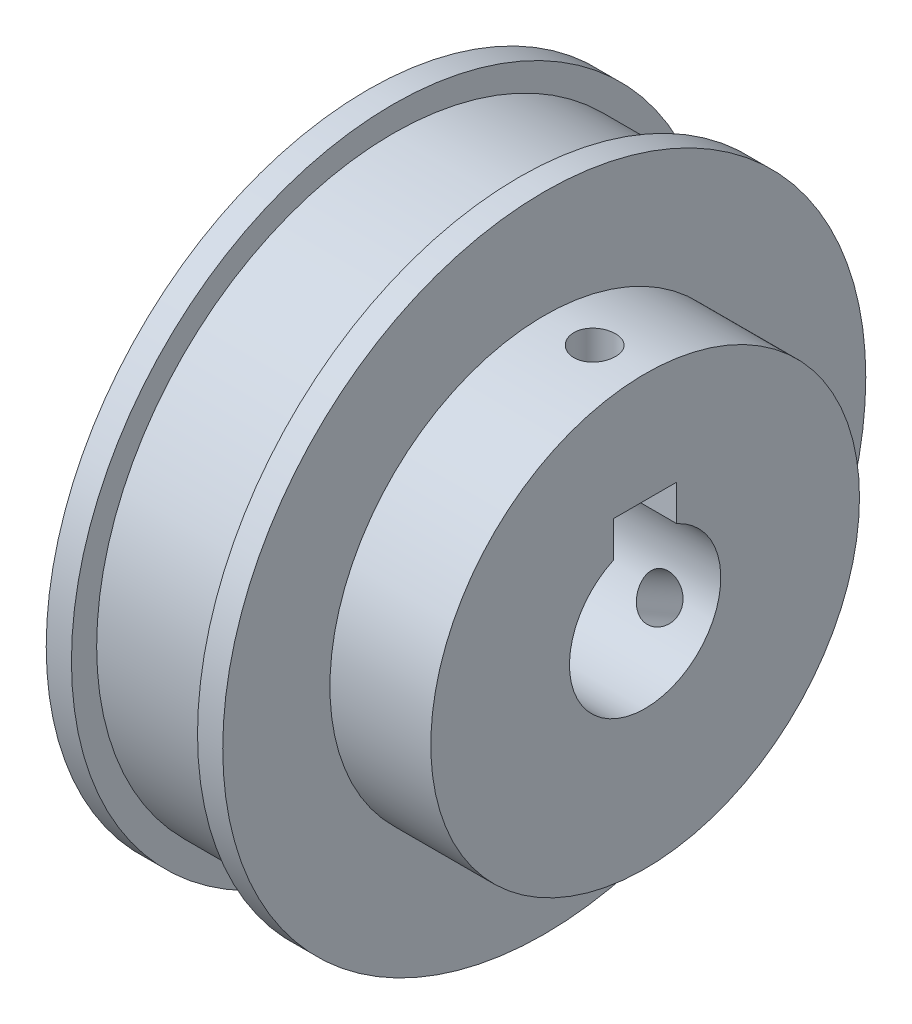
from build123d import *

# Parameters (mm, degrees)
SKETCH_1_R               = 25.5
EXTRUDE_1_DEPTH          = 22
SKETCH_2_OUTSIDE_W       = 68.082
SKETCH_2_OUTSIDE_H       = 68.082
SKETCH_2_OUTSIDE_R       = 23.5
CUT_EXTRUDE_1_DEPTH      = 10
SKETCH_3_OUTSIDE_W       = 68.082
SKETCH_3_OUTSIDE_H       = 68.082
SKETCH_3_OUTSIDE_R       = 17
CUT_EXTRUDE_2_DEPTH      = 8
SKETCH_4_R               = 6
CUT_EXTRUDE_3_DEPTH      = 43.243342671
SKETCH_5_W               = 5
SKETCH_5_H               = 2.845643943
CUT_EXTRUDE_4_DEPTH      = 43.243342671
SKETCH_6_R               = 1.65
CUT_EXTRUDE_5_DEPTH      = 43.243342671
PATTERN_CIRCULAR_1_COUNT = 2
PATTERN_CIRCULAR_1_ANGLE = 120


with BuildPart() as part:
    # Sketch 1 → Extrude 1 (new body)
    with BuildSketch(Plane(origin=(0, 0, 0), x_dir=(0, 0, -1), z_dir=(1, 0, 0))):
        Circle(SKETCH_1_R)
    extrude(amount=EXTRUDE_1_DEPTH)

    # Sketch 2 outside → Cut-Extrude 1 (cut)
    with BuildSketch(Plane(origin=(2, 0, 0), x_dir=(0, 0, -1), z_dir=(1, 0, 0))):
        Rectangle(SKETCH_2_OUTSIDE_W, SKETCH_2_OUTSIDE_H)
        Circle(SKETCH_2_OUTSIDE_R, mode=Mode.SUBTRACT)
    extrude(amount=CUT_EXTRUDE_1_DEPTH, mode=Mode.SUBTRACT)

    # Sketch 3 outside → Cut-Extrude 2 (cut)
    with BuildSketch(Plane(origin=(22, 0, 0), x_dir=(0, 0, -1), z_dir=(1, 0, 0))):
        Rectangle(SKETCH_3_OUTSIDE_W, SKETCH_3_OUTSIDE_H)
        Circle(SKETCH_3_OUTSIDE_R, mode=Mode.SUBTRACT)
    extrude(amount=-CUT_EXTRUDE_2_DEPTH, mode=Mode.SUBTRACT)

    # Sketch 4 → Cut-Extrude 3 (cut, through all)
    with BuildSketch(Plane(origin=(22, 0, 0), x_dir=(0, 0, -1), z_dir=(1, 0, 0))):
        Circle(SKETCH_4_R)
    extrude(amount=-CUT_EXTRUDE_3_DEPTH, mode=Mode.SUBTRACT)

    # Sketch 5 → Cut-Extrude 4 (cut, through all)
    with BuildSketch(Plane(origin=(22, 0, 0), x_dir=(0, 0, -1), z_dir=(1, 0, 0))):
        with Locations((0, 6.877178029)):
            Rectangle(SKETCH_5_W, SKETCH_5_H)
    extrude(amount=-CUT_EXTRUDE_4_DEPTH, mode=Mode.SUBTRACT)

    # Sketch 6 → Cut-Extrude 5 (cut, through all)
    with BuildSketch(Plane(origin=(0, 0, 0), x_dir=(1, 0, 0), z_dir=(0, 1, 0))):
        with Locations(Location((18, 0, 0), (0, 0, 90))):
            Circle(SKETCH_6_R)
    cut_extrude_5 = extrude(amount=CUT_EXTRUDE_5_DEPTH, mode=Mode.SUBTRACT)

    # Pattern Circular 1: Cut-Extrude 5 ×2 about axis
    pattern_circular_1_axis = Axis((14, 0, 0), (-1, 0, 0))
    for i in range(1, PATTERN_CIRCULAR_1_COUNT):
        add(cut_extrude_5.rotate(pattern_circular_1_axis, i * PATTERN_CIRCULAR_1_ANGLE / (PATTERN_CIRCULAR_1_COUNT - 1)), mode=Mode.SUBTRACT)


solid = part.part
